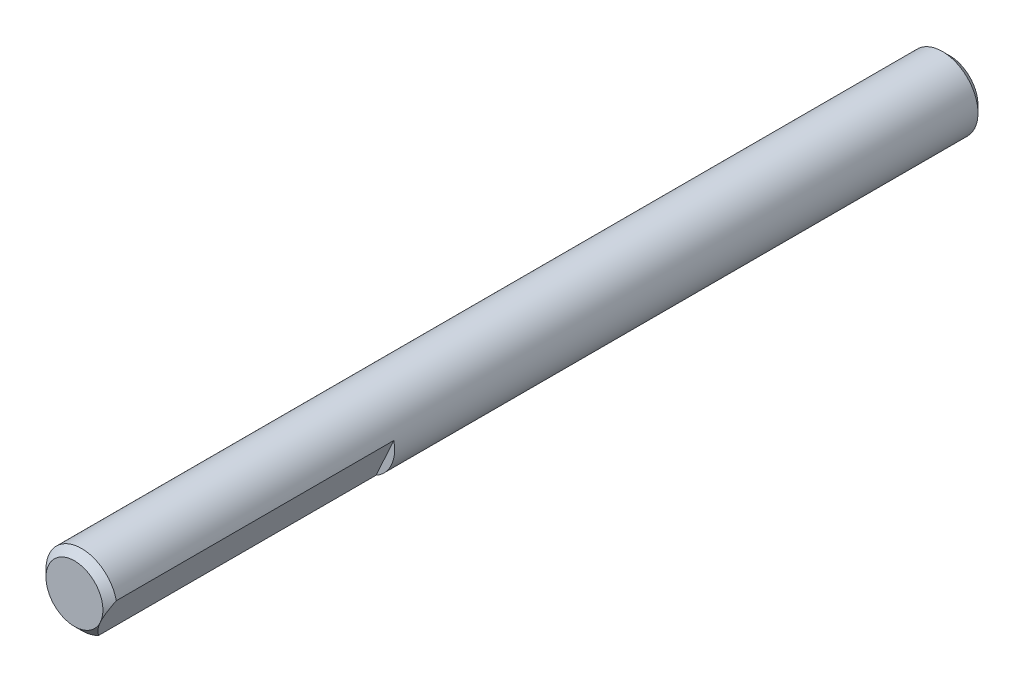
ISO-10303-21;
HEADER;
FILE_DESCRIPTION(('STEP AP214'),'2;1');
FILE_NAME('part.step','',(''),(''),'','','');
FILE_SCHEMA(('AUTOMOTIVE_DESIGN { 1 0 10303 214 1 1 1 1 }'));
ENDSEC;
DATA;
#1=APPLICATION_CONTEXT('core data for automotive mechanical design processes');
#2=APPLICATION_PROTOCOL_DEFINITION('international standard','automotive_design',2000,#1);
#3=PRODUCT_CONTEXT('',#1,'mechanical');
#4=PRODUCT('Part','Part','',(#3));
#5=PRODUCT_RELATED_PRODUCT_CATEGORY('part','',(#4));
#6=PRODUCT_DEFINITION_FORMATION('','',#4);
#7=PRODUCT_DEFINITION_CONTEXT('part definition',#1,'design');
#8=PRODUCT_DEFINITION('design','',#6,#7);
#9=PRODUCT_DEFINITION_SHAPE('','',#8);
#10=(LENGTH_UNIT() NAMED_UNIT(*) SI_UNIT(.MILLI.,.METRE.));
#11=(NAMED_UNIT(*) PLANE_ANGLE_UNIT() SI_UNIT($,.RADIAN.));
#12=(NAMED_UNIT(*) SI_UNIT($,.STERADIAN.) SOLID_ANGLE_UNIT());
#13=UNCERTAINTY_MEASURE_WITH_UNIT(LENGTH_MEASURE(1.E-05),#10,'distance_accuracy_value','');
#14=(GEOMETRIC_REPRESENTATION_CONTEXT(3) GLOBAL_UNCERTAINTY_ASSIGNED_CONTEXT((#13)) GLOBAL_UNIT_ASSIGNED_CONTEXT((#10,
#11,#12)) REPRESENTATION_CONTEXT('',''));
#15=CARTESIAN_POINT('',(0.,0.,0.));
#16=DIRECTION('',(0.,0.,1.));
#17=DIRECTION('',(1.,0.,0.));
#18=AXIS2_PLACEMENT_3D('',#15,#16,#17);
#19=CARTESIAN_POINT('',(-10.395502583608,104.617151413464,61.6999999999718));
#20=DIRECTION('',(0.,0.,-1.));
#21=DIRECTION('',(-1.,0.,0.));
#22=AXIS2_PLACEMENT_3D('',#19,#20,#21);
#23=CONICAL_SURFACE('',#22,2.5,0.785398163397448);
#24=CARTESIAN_POINT('',(-7.95460565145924,105.158151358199,61.6998682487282));
#25=CARTESIAN_POINT('',(-7.98498538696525,105.091107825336,61.743984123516));
#26=CARTESIAN_POINT('',(-8.01574814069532,105.023219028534,61.7866769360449));
#27=CARTESIAN_POINT('',(-8.07828245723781,104.885215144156,61.8682179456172));
#28=CARTESIAN_POINT('',(-8.11005753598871,104.81509229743,61.9070502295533));
#29=CARTESIAN_POINT('',(-8.17520445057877,104.671322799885,61.9801589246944));
#30=CARTESIAN_POINT('',(-8.2085947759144,104.597635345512,62.0143401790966));
#31=CARTESIAN_POINT('',(-8.27644199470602,104.447906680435,62.0755560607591));
#32=CARTESIAN_POINT('',(-8.3108971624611,104.371869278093,62.1026016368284));
#33=CARTESIAN_POINT('',(-8.3699202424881,104.241614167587,62.1406671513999));
#34=CARTESIAN_POINT('',(-8.39422755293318,104.18797156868,62.154054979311));
#35=CARTESIAN_POINT('',(-8.44321966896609,104.079853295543,62.1759695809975));
#36=CARTESIAN_POINT('',(-8.46790447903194,104.025377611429,62.1844962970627));
#37=CARTESIAN_POINT('',(-8.51727020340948,103.916434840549,62.1961907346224));
#38=CARTESIAN_POINT('',(-8.54194919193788,103.861972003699,62.1994055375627));
#39=CARTESIAN_POINT('',(-8.59132586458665,103.753005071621,62.2004437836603));
#40=CARTESIAN_POINT('',(-8.61602354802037,103.69850097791,62.1982674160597));
#41=CARTESIAN_POINT('',(-8.66519065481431,103.589996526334,62.1886550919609));
#42=CARTESIAN_POINT('',(-8.68966044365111,103.535995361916,62.18122998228));
#43=CARTESIAN_POINT('',(-8.73826843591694,103.428724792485,62.161518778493));
#44=CARTESIAN_POINT('',(-8.76240646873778,103.375455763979,62.1492302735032));
#45=CARTESIAN_POINT('',(-8.8345215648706,103.216308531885,62.1056637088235));
#46=CARTESIAN_POINT('',(-8.88182873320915,103.111908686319,62.0677709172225));
#47=CARTESIAN_POINT('',(-8.95127164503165,102.958658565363,62.0014290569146));
#48=CARTESIAN_POINT('',(-8.97422405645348,102.908006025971,61.9776569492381));
#49=CARTESIAN_POINT('',(-9.01964015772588,102.807779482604,61.9274613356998));
#50=CARTESIAN_POINT('',(-9.04210375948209,102.75820567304,61.9010373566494));
#51=CARTESIAN_POINT('',(-9.08620828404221,102.660873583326,61.8464509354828));
#52=CARTESIAN_POINT('',(-9.10785662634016,102.613098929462,61.8183232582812));
#53=CARTESIAN_POINT('',(-9.15072992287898,102.518483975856,61.7603227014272));
#54=CARTESIAN_POINT('',(-9.1719551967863,102.471642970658,61.7304512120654));
#55=CARTESIAN_POINT('',(-9.19299949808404,102.425201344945,61.6998682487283));
#56=B_SPLINE_CURVE_WITH_KNOTS('',3,(#24,#25,#26,#27,#28,#29,#30,#31,#32,#33,#34,#35,#36,#37,#38,
#39,#40,#41,#42,#43,#44,#45,#46,#47,#48,#49,#50,#51,#52,#53,#54,#55),.UNSPECIFIED.,.F.,.F.,(4,2,
2,2,2,2,2,2,2,2,2,2,2,2,2,4),(0.,0.257521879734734,0.516064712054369,0.779286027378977,
1.0421010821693,1.22311240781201,1.40412588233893,1.5835261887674,1.76292019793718,
1.9419445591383,2.12105777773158,2.48196312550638,2.66336263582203,2.84479457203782,
3.02331061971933,3.20168623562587),.UNSPECIFIED.);
#57=CARTESIAN_POINT('',(-7.95469627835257,105.157951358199,61.6999999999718));
#58=VERTEX_POINT('',#57);
#59=CARTESIAN_POINT('',(-8.57380257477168,103.791676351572,62.1999999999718));
#60=VERTEX_POINT('',#59);
#61=EDGE_CURVE('E54',#58,#60,#56,.T.);
#62=ORIENTED_EDGE('',*,*,#61,.F.);
#63=CARTESIAN_POINT('',(-10.395502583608,104.617151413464,61.6999999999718));
#64=DIRECTION('',(0.,0.,-1.));
#65=DIRECTION('',(-1.,0.,0.));
#66=AXIS2_PLACEMENT_3D('',#63,#64,#65);
#67=CIRCLE('',#66,2.5);
#68=CARTESIAN_POINT('',(-9.19290887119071,102.425401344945,61.6999999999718));
#69=VERTEX_POINT('',#68);
#70=EDGE_CURVE('E75',#69,#58,#67,.T.);
#71=ORIENTED_EDGE('',*,*,#70,.F.);
#72=EDGE_CURVE('E69',#60,#69,#56,.T.);
#73=ORIENTED_EDGE('',*,*,#72,.F.);
#74=CARTESIAN_POINT('',(-10.395502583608,104.617151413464,62.1999999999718));
#75=DIRECTION('',(0.,0.,-1.));
#76=DIRECTION('',(-1.,0.,0.));
#77=AXIS2_PLACEMENT_3D('',#74,#75,#76);
#78=CIRCLE('',#77,2.);
#79=EDGE_CURVE('E77',#60,#60,#78,.T.);
#80=ORIENTED_EDGE('',*,*,#79,.T.);
#81=EDGE_LOOP('',(#62,#71,#73,#80));
#82=FACE_BOUND('',#81,.T.);
#83=ADVANCED_FACE('F33',(#82),#23,.T.);
#84=CARTESIAN_POINT('',(-8.39550258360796,104.617151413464,62.1999999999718));
#85=DIRECTION('',(0.,0.,1.));
#86=DIRECTION('',(1.,0.,0.));
#87=AXIS2_PLACEMENT_3D('',#84,#85,#86);
#88=PLANE('',#87);
#89=ORIENTED_EDGE('',*,*,#79,.F.);
#90=EDGE_LOOP('',(#89));
#91=FACE_BOUND('',#90,.T.);
#92=ADVANCED_FACE('F100',(#91),#88,.T.);
#93=CARTESIAN_POINT('',(-10.395502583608,104.617151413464,0.699999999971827));
#94=DIRECTION('',(0.,0.,-1.));
#95=DIRECTION('',(-1.,0.,0.));
#96=AXIS2_PLACEMENT_3D('',#93,#94,#95);
#97=PLANE('',#96);
#98=CARTESIAN_POINT('',(-10.395502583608,104.617151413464,0.699999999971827));
#99=DIRECTION('',(0.,0.,-1.));
#100=DIRECTION('',(-1.,0.,0.));
#101=AXIS2_PLACEMENT_3D('',#98,#99,#100);
#102=CIRCLE('',#101,2.00000000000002);
#103=CARTESIAN_POINT('',(-12.395502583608,104.617151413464,0.699999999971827));
#104=VERTEX_POINT('',#103);
#105=EDGE_CURVE('E80',#104,#104,#102,.T.);
#106=ORIENTED_EDGE('',*,*,#105,.T.);
#107=EDGE_LOOP('',(#106));
#108=FACE_BOUND('',#107,.T.);
#109=ADVANCED_FACE('F98',(#108),#97,.T.);
#110=CARTESIAN_POINT('',(-10.395502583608,104.617151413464,62.1999999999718));
#111=DIRECTION('',(0.,0.,-1.));
#112=DIRECTION('',(-1.,0.,0.));
#113=AXIS2_PLACEMENT_3D('',#110,#111,#112);
#114=CYLINDRICAL_SURFACE('',#113,2.5);
#115=DIRECTION('',(0.,0.,-1.));
#116=VECTOR('',#115,1.);
#117=CARTESIAN_POINT('',(-7.95469627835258,105.157951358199,62.1999999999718));
#118=LINE('',#117,#116);
#119=CARTESIAN_POINT('',(-7.95469627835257,105.157951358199,42.1999999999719));
#120=VERTEX_POINT('',#119);
#121=EDGE_CURVE('E11',#120,#58,#118,.F.);
#122=ORIENTED_EDGE('',*,*,#121,.F.);
#123=CARTESIAN_POINT('',(-10.395502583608,104.617151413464,42.1999999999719));
#124=DIRECTION('',(0.,0.,-1.));
#125=DIRECTION('',(-1.,0.,0.));
#126=AXIS2_PLACEMENT_3D('',#123,#124,#125);
#127=CIRCLE('',#126,2.49999999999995);
#128=CARTESIAN_POINT('',(-9.19290887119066,102.425401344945,42.1999999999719));
#129=VERTEX_POINT('',#128);
#130=EDGE_CURVE('E62',#120,#129,#127,.T.);
#131=ORIENTED_EDGE('',*,*,#130,.T.);
#132=DIRECTION('',(0.,0.,-1.));
#133=VECTOR('',#132,1.);
#134=CARTESIAN_POINT('',(-9.1929088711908,102.425401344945,62.1999999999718));
#135=LINE('',#134,#133);
#136=EDGE_CURVE('E41',#69,#129,#135,.T.);
#137=ORIENTED_EDGE('',*,*,#136,.F.);
#138=ORIENTED_EDGE('',*,*,#70,.T.);
#139=EDGE_LOOP('',(#122,#131,#137,#138));
#140=FACE_BOUND('',#139,.T.);
#141=CARTESIAN_POINT('',(-10.395502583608,104.617151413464,1.19999999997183));
#142=DIRECTION('',(0.,0.,-1.));
#143=DIRECTION('',(-1.,0.,0.));
#144=AXIS2_PLACEMENT_3D('',#141,#142,#143);
#145=CIRCLE('',#144,2.5);
#146=CARTESIAN_POINT('',(-12.895502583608,104.617151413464,1.19999999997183));
#147=VERTEX_POINT('',#146);
#148=EDGE_CURVE('E90',#147,#147,#145,.F.);
#149=ORIENTED_EDGE('',*,*,#148,.T.);
#150=EDGE_LOOP('',(#149));
#151=FACE_BOUND('',#150,.T.);
#152=ADVANCED_FACE('F72',(#140,#151),#114,.T.);
#153=CARTESIAN_POINT('',(-10.395502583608,104.617151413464,0.699999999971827));
#154=DIRECTION('',(0.,0.,1.));
#155=DIRECTION('',(1.,0.,0.));
#156=AXIS2_PLACEMENT_3D('',#153,#154,#155);
#157=CONICAL_SURFACE('',#156,2.00000000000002,0.78539816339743);
#158=ORIENTED_EDGE('',*,*,#148,.F.);
#159=EDGE_LOOP('',(#158));
#160=FACE_BOUND('',#159,.T.);
#161=ORIENTED_EDGE('',*,*,#105,.F.);
#162=EDGE_LOOP('',(#161));
#163=FACE_BOUND('',#162,.T.);
#164=ADVANCED_FACE('F35',(#160,#163),#157,.T.);
#165=CARTESIAN_POINT('',(-9.19290887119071,102.425401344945,65.1999999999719));
#166=DIRECTION('',(-0.910850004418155,0.412737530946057,0.));
#167=DIRECTION('',(-0.412737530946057,-0.910850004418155,0.));
#168=AXIS2_PLACEMENT_3D('',#165,#166,#167);
#169=PLANE('',#168);
#170=ORIENTED_EDGE('',*,*,#61,.T.);
#171=ORIENTED_EDGE('',*,*,#72,.T.);
#172=ORIENTED_EDGE('',*,*,#136,.T.);
#173=DIRECTION('',(0.412737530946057,0.910850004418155,0.));
#174=VECTOR('',#173,1.);
#175=CARTESIAN_POINT('',(-9.19290887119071,102.425401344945,42.1999999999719));
#176=LINE('',#175,#174);
#177=EDGE_CURVE('E47',#129,#120,#176,.T.);
#178=ORIENTED_EDGE('',*,*,#177,.T.);
#179=ORIENTED_EDGE('',*,*,#121,.T.);
#180=EDGE_LOOP('',(#170,#171,#172,#178,#179));
#181=FACE_BOUND('',#180,.T.);
#182=ADVANCED_FACE('F68',(#181),#169,.F.);
#183=CARTESIAN_POINT('',(-10.395502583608,104.617151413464,42.1999999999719));
#184=DIRECTION('',(0.,0.,-1.));
#185=DIRECTION('',(-1.,0.,0.));
#186=AXIS2_PLACEMENT_3D('',#183,#184,#185);
#187=PLANE('',#186);
#188=ORIENTED_EDGE('',*,*,#130,.F.);
#189=ORIENTED_EDGE('',*,*,#177,.F.);
#190=EDGE_LOOP('',(#188,#189));
#191=FACE_BOUND('',#190,.T.);
#192=ADVANCED_FACE('F63',(#191),#187,.F.);
#193=CLOSED_SHELL('',(#83,#92,#109,#152,#164,#182,#192));
#194=MANIFOLD_SOLID_BREP('B2',#193);
#195=ADVANCED_BREP_SHAPE_REPRESENTATION('',(#18,#194),#14);
#196=SHAPE_DEFINITION_REPRESENTATION(#9,#195);
ENDSEC;
END-ISO-10303-21;
